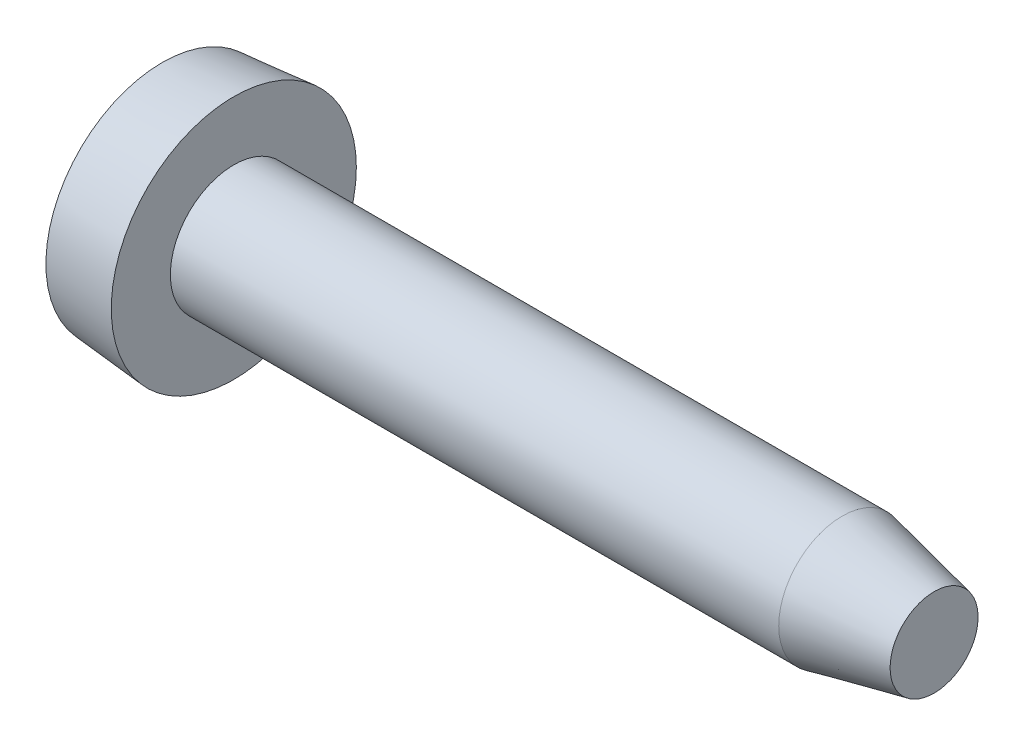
ISO-10303-21;
HEADER;
FILE_DESCRIPTION(('STEP AP214'),'2;1');
FILE_NAME('part.step','',(''),(''),'','','');
FILE_SCHEMA(('AUTOMOTIVE_DESIGN { 1 0 10303 214 1 1 1 1 }'));
ENDSEC;
DATA;
#1=APPLICATION_CONTEXT('core data for automotive mechanical design processes');
#2=APPLICATION_PROTOCOL_DEFINITION('international standard','automotive_design',2000,#1);
#3=PRODUCT_CONTEXT('',#1,'mechanical');
#4=PRODUCT('Part','Part','',(#3));
#5=PRODUCT_RELATED_PRODUCT_CATEGORY('part','',(#4));
#6=PRODUCT_DEFINITION_FORMATION('','',#4);
#7=PRODUCT_DEFINITION_CONTEXT('part definition',#1,'design');
#8=PRODUCT_DEFINITION('design','',#6,#7);
#9=PRODUCT_DEFINITION_SHAPE('','',#8);
#10=(LENGTH_UNIT() NAMED_UNIT(*) SI_UNIT(.MILLI.,.METRE.));
#11=(NAMED_UNIT(*) PLANE_ANGLE_UNIT() SI_UNIT($,.RADIAN.));
#12=(NAMED_UNIT(*) SI_UNIT($,.STERADIAN.) SOLID_ANGLE_UNIT());
#13=UNCERTAINTY_MEASURE_WITH_UNIT(LENGTH_MEASURE(1.E-05),#10,'distance_accuracy_value','');
#14=(GEOMETRIC_REPRESENTATION_CONTEXT(3) GLOBAL_UNCERTAINTY_ASSIGNED_CONTEXT((#13)) GLOBAL_UNIT_ASSIGNED_CONTEXT((#10,
#11,#12)) REPRESENTATION_CONTEXT('',''));
#15=CARTESIAN_POINT('',(0.,0.,0.));
#16=DIRECTION('',(0.,0.,1.));
#17=DIRECTION('',(1.,0.,0.));
#18=AXIS2_PLACEMENT_3D('',#15,#16,#17);
#19=CARTESIAN_POINT('',(-1.70366554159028,0.,-0.255));
#20=DIRECTION('',(0.,0.,1.));
#21=DIRECTION('',(1.,0.,0.));
#22=AXIS2_PLACEMENT_3D('',#19,#20,#21);
#23=PLANE('',#22);
#24=CARTESIAN_POINT('',(-2.38697804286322,-0.254999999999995,-0.255));
#25=CARTESIAN_POINT('',(-2.38080941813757,-0.375863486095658,-0.255000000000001));
#26=CARTESIAN_POINT('',(-2.37022720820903,-0.496488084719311,-0.255));
#27=CARTESIAN_POINT('',(-2.34040446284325,-0.736102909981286,-0.255));
#28=CARTESIAN_POINT('',(-2.321203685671,-0.855098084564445,-0.254999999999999));
#29=CARTESIAN_POINT('',(-2.26269549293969,-1.14959225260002,-0.255));
#30=CARTESIAN_POINT('',(-2.21814295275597,-1.32406276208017,-0.255000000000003));
#31=CARTESIAN_POINT('',(-2.16423628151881,-1.4956696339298,-0.25500000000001));
#32=B_SPLINE_CURVE_WITH_KNOTS('',3,(#24,#25,#26,#27,#28,#29,#30,#31),.UNSPECIFIED.,.F.,.F.,(4,2,
2,4),(0.,0.362956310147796,0.724255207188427,1.26345566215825),.UNSPECIFIED.);
#33=CARTESIAN_POINT('',(-2.38697804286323,-0.254999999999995,-0.255));
#34=VERTEX_POINT('',#33);
#35=CARTESIAN_POINT('',(-2.16423628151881,-1.49566963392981,-0.255000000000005));
#36=VERTEX_POINT('',#35);
#37=EDGE_CURVE('E19',#34,#36,#32,.T.);
#38=ORIENTED_EDGE('',*,*,#37,.T.);
#39=DIRECTION('',(0.78348098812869,0.621415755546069,0.));
#40=VECTOR('',#39,1.);
#41=CARTESIAN_POINT('',(-0.599999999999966,-0.254999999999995,-0.255));
#42=LINE('',#41,#40);
#43=CARTESIAN_POINT('',(-0.599999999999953,-0.254999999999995,-0.254999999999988));
#44=VERTEX_POINT('',#43);
#45=EDGE_CURVE('E79',#36,#44,#42,.T.);
#46=ORIENTED_EDGE('',*,*,#45,.T.);
#47=DIRECTION('',(1.,0.,0.));
#48=VECTOR('',#47,1.);
#49=CARTESIAN_POINT('',(-1.70366554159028,-0.254999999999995,-0.255));
#50=LINE('',#49,#48);
#51=EDGE_CURVE('E221',#44,#34,#50,.F.);
#52=ORIENTED_EDGE('',*,*,#51,.T.);
#53=EDGE_LOOP('',(#38,#46,#52));
#54=FACE_BOUND('',#53,.T.);
#55=ADVANCED_FACE('F15',(#54),#23,.T.);
#56=CARTESIAN_POINT('',(-1.70366554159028,-0.254999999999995,0.));
#57=DIRECTION('',(0.,-1.,0.));
#58=DIRECTION('',(0.,0.,-1.));
#59=AXIS2_PLACEMENT_3D('',#56,#57,#58);
#60=PLANE('',#59);
#61=ORIENTED_EDGE('',*,*,#51,.F.);
#62=DIRECTION('',(-0.78348098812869,0.,-0.621415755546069));
#63=VECTOR('',#62,1.);
#64=CARTESIAN_POINT('',(-0.599999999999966,-0.254999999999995,-0.254999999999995));
#65=LINE('',#64,#63);
#66=CARTESIAN_POINT('',(-2.16423628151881,-0.255,-1.49566963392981));
#67=VERTEX_POINT('',#66);
#68=EDGE_CURVE('E291',#44,#67,#65,.T.);
#69=ORIENTED_EDGE('',*,*,#68,.T.);
#70=CARTESIAN_POINT('',(-2.38697804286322,-0.254999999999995,-0.255));
#71=CARTESIAN_POINT('',(-2.38080941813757,-0.254999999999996,-0.375863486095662));
#72=CARTESIAN_POINT('',(-2.37022720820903,-0.254999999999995,-0.496488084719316));
#73=CARTESIAN_POINT('',(-2.34040446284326,-0.254999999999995,-0.736102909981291));
#74=CARTESIAN_POINT('',(-2.321203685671,-0.254999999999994,-0.85509808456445));
#75=CARTESIAN_POINT('',(-2.2626954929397,-0.254999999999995,-1.14959225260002));
#76=CARTESIAN_POINT('',(-2.21814295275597,-0.254999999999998,-1.32406276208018));
#77=CARTESIAN_POINT('',(-2.16423628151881,-0.255000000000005,-1.4956696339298));
#78=B_SPLINE_CURVE_WITH_KNOTS('',3,(#70,#71,#72,#73,#74,#75,#76,#77),.UNSPECIFIED.,.F.,.F.,(4,2,
2,4),(0.,0.362956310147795,0.724255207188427,1.26345566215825),.UNSPECIFIED.);
#79=EDGE_CURVE('E216',#34,#67,#78,.T.);
#80=ORIENTED_EDGE('',*,*,#79,.F.);
#81=EDGE_LOOP('',(#61,#69,#80));
#82=FACE_BOUND('',#81,.T.);
#83=ADVANCED_FACE('F222',(#82),#60,.F.);
#84=CARTESIAN_POINT('',(-0.599999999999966,-0.254999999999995,0.));
#85=DIRECTION('',(0.621415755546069,-0.78348098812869,0.));
#86=DIRECTION('',(0.78348098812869,0.621415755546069,0.));
#87=AXIS2_PLACEMENT_3D('',#84,#85,#86);
#88=PLANE('',#87);
#89=DIRECTION('',(0.783480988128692,0.621415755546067,0.));
#90=VECTOR('',#89,1.);
#91=CARTESIAN_POINT('',(-2.16423628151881,-1.49566963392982,0.255));
#92=LINE('',#91,#90);
#93=CARTESIAN_POINT('',(-2.16423628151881,-1.49566963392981,0.255000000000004));
#94=VERTEX_POINT('',#93);
#95=CARTESIAN_POINT('',(-0.599999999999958,-0.254999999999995,0.25500000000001));
#96=VERTEX_POINT('',#95);
#97=EDGE_CURVE('E330',#94,#96,#92,.T.);
#98=ORIENTED_EDGE('',*,*,#97,.T.);
#99=DIRECTION('',(0.,0.,1.));
#100=VECTOR('',#99,1.);
#101=CARTESIAN_POINT('',(-0.599999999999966,-0.254999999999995,0.));
#102=LINE('',#101,#100);
#103=EDGE_CURVE('E98',#44,#96,#102,.T.);
#104=ORIENTED_EDGE('',*,*,#103,.F.);
#105=ORIENTED_EDGE('',*,*,#45,.F.);
#106=CARTESIAN_POINT('',(-2.1642362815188,-1.49566963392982,0.255));
#107=CARTESIAN_POINT('',(-2.16787609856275,-1.49855654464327,0.17));
#108=CARTESIAN_POINT('',(-2.16969600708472,-1.5,0.0850000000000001));
#109=CARTESIAN_POINT('',(-2.16969600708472,-1.5,-0.0849999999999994));
#110=CARTESIAN_POINT('',(-2.16787609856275,-1.49855654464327,-0.169999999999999));
#111=CARTESIAN_POINT('',(-2.1642362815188,-1.49566963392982,-0.254999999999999));
#112=B_SPLINE_CURVE_WITH_KNOTS('',3,(#106,#107,#108,#109,#110,#111),.UNSPECIFIED.,.F.,.F.,(4,2,
4),(0.,0.255095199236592,0.510190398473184),.UNSPECIFIED.);
#113=EDGE_CURVE('E211',#94,#36,#112,.T.);
#114=ORIENTED_EDGE('',*,*,#113,.F.);
#115=EDGE_LOOP('',(#98,#104,#105,#114));
#116=FACE_BOUND('',#115,.T.);
#117=ADVANCED_FACE('F225',(#116),#88,.F.);
#118=CARTESIAN_POINT('',(-0.599999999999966,0.,-0.254999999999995));
#119=DIRECTION('',(0.621415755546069,0.,-0.78348098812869));
#120=DIRECTION('',(-0.78348098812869,0.,-0.621415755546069));
#121=AXIS2_PLACEMENT_3D('',#118,#119,#120);
#122=PLANE('',#121);
#123=ORIENTED_EDGE('',*,*,#68,.F.);
#124=DIRECTION('',(0.,1.,0.));
#125=VECTOR('',#124,1.);
#126=CARTESIAN_POINT('',(-0.599999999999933,0.,-0.254999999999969));
#127=LINE('',#126,#125);
#128=CARTESIAN_POINT('',(-0.599999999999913,0.254999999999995,-0.254999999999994));
#129=VERTEX_POINT('',#128);
#130=EDGE_CURVE('E289',#129,#44,#127,.F.);
#131=ORIENTED_EDGE('',*,*,#130,.F.);
#132=DIRECTION('',(0.783480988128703,0.,0.621415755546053));
#133=VECTOR('',#132,1.);
#134=CARTESIAN_POINT('',(-2.16423628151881,0.254999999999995,-1.49566963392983));
#135=LINE('',#134,#133);
#136=CARTESIAN_POINT('',(-2.16423628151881,0.254999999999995,-1.49566963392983));
#137=VERTEX_POINT('',#136);
#138=EDGE_CURVE('E323',#137,#129,#135,.T.);
#139=ORIENTED_EDGE('',*,*,#138,.F.);
#140=CARTESIAN_POINT('',(-2.16423628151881,-0.254999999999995,-1.49566963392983));
#141=CARTESIAN_POINT('',(-2.16787609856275,-0.169999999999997,-1.49855654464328));
#142=CARTESIAN_POINT('',(-2.16969600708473,-0.084999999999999,-1.5));
#143=CARTESIAN_POINT('',(-2.16969600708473,0.084999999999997,-1.5));
#144=CARTESIAN_POINT('',(-2.16787609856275,0.169999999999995,-1.49855654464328));
#145=CARTESIAN_POINT('',(-2.16423628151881,0.254999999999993,-1.49566963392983));
#146=B_SPLINE_CURVE_WITH_KNOTS('',3,(#140,#141,#142,#143,#144,#145),.UNSPECIFIED.,.F.,.F.,(4,2,
4),(0.,0.255095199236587,0.510190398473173),.UNSPECIFIED.);
#147=EDGE_CURVE('E205',#67,#137,#146,.T.);
#148=ORIENTED_EDGE('',*,*,#147,.F.);
#149=EDGE_LOOP('',(#123,#131,#139,#148));
#150=FACE_BOUND('',#149,.T.);
#151=ADVANCED_FACE('F230',(#150),#122,.F.);
#152=CARTESIAN_POINT('',(-1.70366554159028,0.,0.255));
#153=DIRECTION('',(0.,0.,1.));
#154=DIRECTION('',(1.,0.,0.));
#155=AXIS2_PLACEMENT_3D('',#152,#153,#154);
#156=PLANE('',#155);
#157=ORIENTED_EDGE('',*,*,#97,.F.);
#158=CARTESIAN_POINT('',(-2.38697804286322,-0.254999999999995,0.255));
#159=CARTESIAN_POINT('',(-2.38080941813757,-0.375863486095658,0.255));
#160=CARTESIAN_POINT('',(-2.37022720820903,-0.496488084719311,0.255));
#161=CARTESIAN_POINT('',(-2.34040446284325,-0.736102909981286,0.255));
#162=CARTESIAN_POINT('',(-2.321203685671,-0.855098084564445,0.255));
#163=CARTESIAN_POINT('',(-2.26269549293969,-1.14959225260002,0.255000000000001));
#164=CARTESIAN_POINT('',(-2.21814295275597,-1.32406276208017,0.255000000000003));
#165=CARTESIAN_POINT('',(-2.16423628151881,-1.4956696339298,0.255000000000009));
#166=B_SPLINE_CURVE_WITH_KNOTS('',3,(#158,#159,#160,#161,#162,#163,#164,#165),.UNSPECIFIED.,.F.,
.F.,(4,2,2,4),(0.,0.362956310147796,0.724255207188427,1.26345566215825),.UNSPECIFIED.);
#167=CARTESIAN_POINT('',(-2.38697804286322,-0.254999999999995,0.255));
#168=VERTEX_POINT('',#167);
#169=EDGE_CURVE('E198',#168,#94,#166,.T.);
#170=ORIENTED_EDGE('',*,*,#169,.F.);
#171=DIRECTION('',(1.,0.,0.));
#172=VECTOR('',#171,1.);
#173=CARTESIAN_POINT('',(-1.70366554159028,-0.254999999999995,0.255));
#174=LINE('',#173,#172);
#175=EDGE_CURVE('E320',#168,#96,#174,.T.);
#176=ORIENTED_EDGE('',*,*,#175,.T.);
#177=EDGE_LOOP('',(#157,#170,#176));
#178=FACE_BOUND('',#177,.T.);
#179=ADVANCED_FACE('F234',(#178),#156,.F.);
#180=CARTESIAN_POINT('',(-1.70366554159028,0.254999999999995,0.));
#181=DIRECTION('',(0.,-1.,0.));
#182=DIRECTION('',(0.,0.,-1.));
#183=AXIS2_PLACEMENT_3D('',#180,#181,#182);
#184=PLANE('',#183);
#185=ORIENTED_EDGE('',*,*,#138,.T.);
#186=DIRECTION('',(1.,0.,0.));
#187=VECTOR('',#186,1.);
#188=CARTESIAN_POINT('',(-1.70366554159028,0.254999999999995,-0.255));
#189=LINE('',#188,#187);
#190=CARTESIAN_POINT('',(-2.38697804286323,0.254999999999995,-0.255));
#191=VERTEX_POINT('',#190);
#192=EDGE_CURVE('E316',#191,#129,#189,.T.);
#193=ORIENTED_EDGE('',*,*,#192,.F.);
#194=CARTESIAN_POINT('',(-2.38697804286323,0.254999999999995,-0.255));
#195=CARTESIAN_POINT('',(-2.38080941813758,0.254999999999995,-0.375863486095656));
#196=CARTESIAN_POINT('',(-2.37022720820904,0.254999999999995,-0.496488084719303));
#197=CARTESIAN_POINT('',(-2.34040446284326,0.254999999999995,-0.736102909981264));
#198=CARTESIAN_POINT('',(-2.32120368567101,0.254999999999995,-0.855098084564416));
#199=CARTESIAN_POINT('',(-2.2626954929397,0.254999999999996,-1.1495922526));
#200=CARTESIAN_POINT('',(-2.21814295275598,0.254999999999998,-1.32406276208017));
#201=CARTESIAN_POINT('',(-2.16423628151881,0.255000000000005,-1.4956696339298));
#202=B_SPLINE_CURVE_WITH_KNOTS('',3,(#194,#195,#196,#197,#198,#199,#200,#201),.UNSPECIFIED.,.F.,
.F.,(4,2,2,4),(0.,0.362956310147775,0.724255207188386,1.26345566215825),.UNSPECIFIED.);
#203=EDGE_CURVE('E191',#191,#137,#202,.T.);
#204=ORIENTED_EDGE('',*,*,#203,.T.);
#205=EDGE_LOOP('',(#185,#193,#204));
#206=FACE_BOUND('',#205,.T.);
#207=ADVANCED_FACE('F238',(#206),#184,.T.);
#208=CARTESIAN_POINT('',(-1.70366554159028,-0.254999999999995,0.));
#209=DIRECTION('',(0.,-1.,0.));
#210=DIRECTION('',(0.,0.,-1.));
#211=AXIS2_PLACEMENT_3D('',#208,#209,#210);
#212=PLANE('',#211);
#213=DIRECTION('',(0.783480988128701,0.,-0.621415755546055));
#214=VECTOR('',#213,1.);
#215=CARTESIAN_POINT('',(-2.16969600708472,-0.254999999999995,1.5));
#216=LINE('',#215,#214);
#217=CARTESIAN_POINT('',(-2.16423628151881,-0.254999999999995,1.49566963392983));
#218=VERTEX_POINT('',#217);
#219=EDGE_CURVE('E103',#218,#96,#216,.T.);
#220=ORIENTED_EDGE('',*,*,#219,.T.);
#221=ORIENTED_EDGE('',*,*,#175,.F.);
#222=CARTESIAN_POINT('',(-2.16423628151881,-0.254999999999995,1.49566963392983));
#223=CARTESIAN_POINT('',(-2.21469075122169,-0.254999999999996,1.3350971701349));
#224=CARTESIAN_POINT('',(-2.25695855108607,-0.254999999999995,1.17192070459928));
#225=CARTESIAN_POINT('',(-2.32461908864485,-0.254999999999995,0.8431826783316));
#226=CARTESIAN_POINT('',(-2.35011698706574,-0.254999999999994,0.677642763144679));
#227=CARTESIAN_POINT('',(-2.37602868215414,-0.254999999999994,0.426031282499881));
#228=CARTESIAN_POINT('',(-2.38261125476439,-0.254999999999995,0.340564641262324));
#229=CARTESIAN_POINT('',(-2.38697804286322,-0.254999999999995,0.254999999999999));
#230=B_SPLINE_CURVE_WITH_KNOTS('',3,(#222,#223,#224,#225,#226,#227,#228,#229),.UNSPECIFIED.,.F.,
.F.,(4,2,2,4),(0.,0.504788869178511,1.00638133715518,1.26342207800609),.UNSPECIFIED.);
#231=EDGE_CURVE('E184',#218,#168,#230,.T.);
#232=ORIENTED_EDGE('',*,*,#231,.F.);
#233=EDGE_LOOP('',(#220,#221,#232));
#234=FACE_BOUND('',#233,.T.);
#235=ADVANCED_FACE('F242',(#234),#212,.F.);
#236=CARTESIAN_POINT('',(-0.599999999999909,0.254999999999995,0.));
#237=DIRECTION('',(1.,-1.114577E-13,0.));
#238=DIRECTION('',(1.114577E-13,1.,0.));
#239=AXIS2_PLACEMENT_3D('',#236,#237,#238);
#240=PLANE('',#239);
#241=DIRECTION('',(0.,0.,1.));
#242=VECTOR('',#241,1.);
#243=CARTESIAN_POINT('',(-0.599999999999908,0.254999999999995,0.));
#244=LINE('',#243,#242);
#245=CARTESIAN_POINT('',(-0.599999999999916,0.254999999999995,0.255000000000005));
#246=VERTEX_POINT('',#245);
#247=EDGE_CURVE('E95',#246,#129,#244,.F.);
#248=ORIENTED_EDGE('',*,*,#247,.T.);
#249=ORIENTED_EDGE('',*,*,#130,.T.);
#250=ORIENTED_EDGE('',*,*,#103,.T.);
#251=DIRECTION('',(0.,1.,0.));
#252=VECTOR('',#251,1.);
#253=CARTESIAN_POINT('',(-0.599999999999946,0.,0.255000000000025));
#254=LINE('',#253,#252);
#255=EDGE_CURVE('E90',#96,#246,#254,.T.);
#256=ORIENTED_EDGE('',*,*,#255,.T.);
#257=EDGE_LOOP('',(#248,#249,#250,#256));
#258=FACE_BOUND('',#257,.T.);
#259=ADVANCED_FACE('F92',(#258),#240,.F.);
#260=CARTESIAN_POINT('',(-1.70366554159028,0.,-0.255));
#261=DIRECTION('',(0.,0.,1.));
#262=DIRECTION('',(1.,0.,0.));
#263=AXIS2_PLACEMENT_3D('',#260,#261,#262);
#264=PLANE('',#263);
#265=DIRECTION('',(-0.783480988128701,0.621415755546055,0.));
#266=VECTOR('',#265,1.);
#267=CARTESIAN_POINT('',(-2.16969600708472,1.5,-0.255));
#268=LINE('',#267,#266);
#269=CARTESIAN_POINT('',(-2.16423628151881,1.49566963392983,-0.255));
#270=VERTEX_POINT('',#269);
#271=EDGE_CURVE('E121',#129,#270,#268,.T.);
#272=ORIENTED_EDGE('',*,*,#271,.T.);
#273=CARTESIAN_POINT('',(-2.16423628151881,1.49566963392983,-0.255));
#274=CARTESIAN_POINT('',(-2.21469075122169,1.33509717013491,-0.254999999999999));
#275=CARTESIAN_POINT('',(-2.25695855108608,1.17192070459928,-0.255));
#276=CARTESIAN_POINT('',(-2.32461908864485,0.843182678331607,-0.255000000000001));
#277=CARTESIAN_POINT('',(-2.35011698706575,0.677642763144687,-0.255000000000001));
#278=CARTESIAN_POINT('',(-2.37602868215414,0.426031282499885,-0.255000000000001));
#279=CARTESIAN_POINT('',(-2.38261125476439,0.340564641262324,-0.255000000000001));
#280=CARTESIAN_POINT('',(-2.38697804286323,0.254999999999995,-0.255));
#281=B_SPLINE_CURVE_WITH_KNOTS('',3,(#273,#274,#275,#276,#277,#278,#279,#280),.UNSPECIFIED.,.F.,
.F.,(4,2,2,4),(0.,0.504788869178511,1.00638133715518,1.26342207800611),.UNSPECIFIED.);
#282=EDGE_CURVE('E177',#270,#191,#281,.T.);
#283=ORIENTED_EDGE('',*,*,#282,.T.);
#284=ORIENTED_EDGE('',*,*,#192,.T.);
#285=EDGE_LOOP('',(#272,#283,#284));
#286=FACE_BOUND('',#285,.T.);
#287=ADVANCED_FACE('F249',(#286),#264,.T.);
#288=CARTESIAN_POINT('',(-2.16969600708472,0.,1.5));
#289=DIRECTION('',(0.621415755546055,0.,0.783480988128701));
#290=DIRECTION('',(0.783480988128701,0.,-0.621415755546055));
#291=AXIS2_PLACEMENT_3D('',#288,#289,#290);
#292=PLANE('',#291);
#293=DIRECTION('',(-0.783480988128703,0.,0.621415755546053));
#294=VECTOR('',#293,1.);
#295=CARTESIAN_POINT('',(-0.599999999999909,0.254999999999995,0.255));
#296=LINE('',#295,#294);
#297=CARTESIAN_POINT('',(-2.16423628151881,0.254999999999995,1.49566963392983));
#298=VERTEX_POINT('',#297);
#299=EDGE_CURVE('E107',#246,#298,#296,.T.);
#300=ORIENTED_EDGE('',*,*,#299,.F.);
#301=ORIENTED_EDGE('',*,*,#255,.F.);
#302=ORIENTED_EDGE('',*,*,#219,.F.);
#303=CARTESIAN_POINT('',(-2.16423628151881,0.254999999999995,1.49566963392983));
#304=CARTESIAN_POINT('',(-2.16787609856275,0.169999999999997,1.49855654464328));
#305=CARTESIAN_POINT('',(-2.16969600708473,0.0849999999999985,1.5));
#306=CARTESIAN_POINT('',(-2.16969600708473,-0.0849999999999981,1.5));
#307=CARTESIAN_POINT('',(-2.16787609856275,-0.169999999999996,1.49855654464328));
#308=CARTESIAN_POINT('',(-2.16423628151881,-0.254999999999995,1.49566963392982));
#309=B_SPLINE_CURVE_WITH_KNOTS('',3,(#303,#304,#305,#306,#307,#308),.UNSPECIFIED.,.F.,.F.,(4,2,
4),(0.,0.255095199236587,0.510190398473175),.UNSPECIFIED.);
#310=EDGE_CURVE('E102',#298,#218,#309,.T.);
#311=ORIENTED_EDGE('',*,*,#310,.F.);
#312=EDGE_LOOP('',(#300,#301,#302,#311));
#313=FACE_BOUND('',#312,.T.);
#314=ADVANCED_FACE('F108',(#313),#292,.F.);
#315=CARTESIAN_POINT('',(-2.16969600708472,1.5,0.));
#316=DIRECTION('',(0.621415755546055,0.783480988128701,0.));
#317=DIRECTION('',(-0.783480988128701,0.621415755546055,0.));
#318=AXIS2_PLACEMENT_3D('',#315,#316,#317);
#319=PLANE('',#318);
#320=ORIENTED_EDGE('',*,*,#271,.F.);
#321=ORIENTED_EDGE('',*,*,#247,.F.);
#322=DIRECTION('',(-0.783480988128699,0.621415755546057,0.));
#323=VECTOR('',#322,1.);
#324=CARTESIAN_POINT('',(-0.599999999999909,0.254999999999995,0.255));
#325=LINE('',#324,#323);
#326=CARTESIAN_POINT('',(-2.16423628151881,1.49566963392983,0.255));
#327=VERTEX_POINT('',#326);
#328=EDGE_CURVE('E112',#246,#327,#325,.T.);
#329=ORIENTED_EDGE('',*,*,#328,.T.);
#330=CARTESIAN_POINT('',(-2.16423628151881,1.49566963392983,-0.254999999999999));
#331=CARTESIAN_POINT('',(-2.16787609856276,1.49855654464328,-0.17));
#332=CARTESIAN_POINT('',(-2.16969600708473,1.5,-0.0849999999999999));
#333=CARTESIAN_POINT('',(-2.16969600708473,1.5,0.0849999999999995));
#334=CARTESIAN_POINT('',(-2.16787609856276,1.49855654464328,0.169999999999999));
#335=CARTESIAN_POINT('',(-2.16423628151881,1.49566963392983,0.254999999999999));
#336=B_SPLINE_CURVE_WITH_KNOTS('',3,(#330,#331,#332,#333,#334,#335),.UNSPECIFIED.,.F.,.F.,(4,2,
4),(0.,0.255095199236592,0.510190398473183),.UNSPECIFIED.);
#337=EDGE_CURVE('E39',#270,#327,#336,.T.);
#338=ORIENTED_EDGE('',*,*,#337,.F.);
#339=EDGE_LOOP('',(#320,#321,#329,#338));
#340=FACE_BOUND('',#339,.T.);
#341=ADVANCED_FACE('F117',(#340),#319,.F.);
#342=CARTESIAN_POINT('',(-1.70366554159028,0.254999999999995,0.));
#343=DIRECTION('',(0.,-1.,0.));
#344=DIRECTION('',(0.,0.,-1.));
#345=AXIS2_PLACEMENT_3D('',#342,#343,#344);
#346=PLANE('',#345);
#347=DIRECTION('',(1.,0.,0.));
#348=VECTOR('',#347,1.);
#349=CARTESIAN_POINT('',(-1.70366554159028,0.254999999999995,0.255));
#350=LINE('',#349,#348);
#351=CARTESIAN_POINT('',(-2.38697804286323,0.254999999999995,0.255));
#352=VERTEX_POINT('',#351);
#353=EDGE_CURVE('E124',#352,#246,#350,.T.);
#354=ORIENTED_EDGE('',*,*,#353,.T.);
#355=ORIENTED_EDGE('',*,*,#299,.T.);
#356=CARTESIAN_POINT('',(-2.16423628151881,0.254999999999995,1.49566963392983));
#357=CARTESIAN_POINT('',(-2.21469075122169,0.254999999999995,1.33509717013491));
#358=CARTESIAN_POINT('',(-2.25695855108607,0.254999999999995,1.17192070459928));
#359=CARTESIAN_POINT('',(-2.32461908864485,0.254999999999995,0.843182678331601));
#360=CARTESIAN_POINT('',(-2.35011698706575,0.254999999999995,0.67764276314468));
#361=CARTESIAN_POINT('',(-2.37602868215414,0.254999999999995,0.426031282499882));
#362=CARTESIAN_POINT('',(-2.38261125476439,0.254999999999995,0.340564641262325));
#363=CARTESIAN_POINT('',(-2.38697804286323,0.254999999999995,0.255));
#364=B_SPLINE_CURVE_WITH_KNOTS('',3,(#356,#357,#358,#359,#360,#361,#362,#363),.UNSPECIFIED.,.F.,
.F.,(4,2,2,4),(0.,0.504788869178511,1.00638133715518,1.26342207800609),.UNSPECIFIED.);
#365=EDGE_CURVE('E113',#298,#352,#364,.T.);
#366=ORIENTED_EDGE('',*,*,#365,.T.);
#367=EDGE_LOOP('',(#354,#355,#366));
#368=FACE_BOUND('',#367,.T.);
#369=ADVANCED_FACE('F125',(#368),#346,.T.);
#370=CARTESIAN_POINT('',(-1.70366554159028,0.,0.255));
#371=DIRECTION('',(0.,0.,1.));
#372=DIRECTION('',(1.,0.,0.));
#373=AXIS2_PLACEMENT_3D('',#370,#371,#372);
#374=PLANE('',#373);
#375=CARTESIAN_POINT('',(-2.16423628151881,1.49566963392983,0.255));
#376=CARTESIAN_POINT('',(-2.21469075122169,1.33509717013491,0.254999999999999));
#377=CARTESIAN_POINT('',(-2.25695855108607,1.17192070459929,0.255));
#378=CARTESIAN_POINT('',(-2.32461908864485,0.84318267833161,0.255));
#379=CARTESIAN_POINT('',(-2.35011698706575,0.677642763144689,0.255000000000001));
#380=CARTESIAN_POINT('',(-2.37602868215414,0.426031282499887,0.255000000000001));
#381=CARTESIAN_POINT('',(-2.38261125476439,0.340564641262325,0.255000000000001));
#382=CARTESIAN_POINT('',(-2.38697804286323,0.254999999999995,0.255));
#383=B_SPLINE_CURVE_WITH_KNOTS('',3,(#375,#376,#377,#378,#379,#380,#381,#382),.UNSPECIFIED.,.F.,
.F.,(4,2,2,4),(0.,0.504788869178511,1.00638133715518,1.26342207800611),.UNSPECIFIED.);
#384=EDGE_CURVE('E127',#327,#352,#383,.T.);
#385=ORIENTED_EDGE('',*,*,#384,.F.);
#386=ORIENTED_EDGE('',*,*,#328,.F.);
#387=ORIENTED_EDGE('',*,*,#353,.F.);
#388=EDGE_LOOP('',(#385,#386,#387));
#389=FACE_BOUND('',#388,.T.);
#390=ADVANCED_FACE('F129',(#389),#374,.F.);
#391=CARTESIAN_POINT('',(2.60000000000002,0.,0.));
#392=DIRECTION('',(1.,0.,0.));
#393=DIRECTION('',(0.,1.,0.));
#394=AXIS2_PLACEMENT_3D('',#391,#392,#393);
#395=SPHERICAL_SURFACE('',#394,5.00000000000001);
#396=CARTESIAN_POINT('',(-1.63566947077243,0.,0.));
#397=DIRECTION('',(1.,0.,0.));
#398=DIRECTION('',(0.,1.,0.));
#399=AXIS2_PLACEMENT_3D('',#396,#397,#398);
#400=CIRCLE('',#399,2.65689746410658);
#401=CARTESIAN_POINT('',(-1.63566947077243,2.65689746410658,0.));
#402=VERTEX_POINT('',#401);
#403=EDGE_CURVE('E138',#402,#402,#400,.T.);
#404=ORIENTED_EDGE('',*,*,#403,.F.);
#405=EDGE_LOOP('',(#404));
#406=FACE_BOUND('',#405,.T.);
#407=ORIENTED_EDGE('',*,*,#337,.T.);
#408=ORIENTED_EDGE('',*,*,#384,.T.);
#409=ORIENTED_EDGE('',*,*,#365,.F.);
#410=ORIENTED_EDGE('',*,*,#310,.T.);
#411=ORIENTED_EDGE('',*,*,#231,.T.);
#412=ORIENTED_EDGE('',*,*,#169,.T.);
#413=ORIENTED_EDGE('',*,*,#113,.T.);
#414=ORIENTED_EDGE('',*,*,#37,.F.);
#415=ORIENTED_EDGE('',*,*,#79,.T.);
#416=ORIENTED_EDGE('',*,*,#147,.T.);
#417=ORIENTED_EDGE('',*,*,#203,.F.);
#418=ORIENTED_EDGE('',*,*,#282,.F.);
#419=EDGE_LOOP('',(#407,#408,#409,#410,#411,#412,#413,#414,#415,#416,#417,#418));
#420=FACE_BOUND('',#419,.T.);
#421=ADVANCED_FACE('F140',(#406,#420),#395,.T.);
#422=CARTESIAN_POINT('',(16.,0.502499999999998,0.));
#423=DIRECTION('',(1.,0.,0.));
#424=DIRECTION('',(0.,0.,-1.));
#425=AXIS2_PLACEMENT_3D('',#422,#423,#424);
#426=PLANE('',#425);
#427=CARTESIAN_POINT('',(16.0000000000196,0.,0.));
#428=DIRECTION('',(-1.,0.,0.));
#429=DIRECTION('',(0.,0.,1.));
#430=AXIS2_PLACEMENT_3D('',#427,#428,#429);
#431=CIRCLE('',#430,1.00500000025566);
#432=CARTESIAN_POINT('',(16.0000000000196,0.,1.00500000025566));
#433=VERTEX_POINT('',#432);
#434=EDGE_CURVE('E279',#433,#433,#431,.T.);
#435=ORIENTED_EDGE('',*,*,#434,.F.);
#436=EDGE_LOOP('',(#435));
#437=FACE_BOUND('',#436,.T.);
#438=ADVANCED_FACE('F145',(#437),#426,.T.);
#439=CARTESIAN_POINT('',(-1.13686837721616E-10,0.,0.));
#440=DIRECTION('',(1.,0.,0.));
#441=DIRECTION('',(0.,0.,-1.));
#442=AXIS2_PLACEMENT_3D('',#439,#440,#441);
#443=CONICAL_SURFACE('',#442,2.7999999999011,0.0872664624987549);
#444=ORIENTED_EDGE('',*,*,#403,.T.);
#445=EDGE_LOOP('',(#444));
#446=FACE_BOUND('',#445,.T.);
#447=CARTESIAN_POINT('',(0.,0.,0.));
#448=DIRECTION('',(1.,0.,0.));
#449=DIRECTION('',(0.,0.,-1.));
#450=AXIS2_PLACEMENT_3D('',#447,#448,#449);
#451=CIRCLE('',#450,2.79999999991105);
#452=CARTESIAN_POINT('',(0.,0.,-2.79999999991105));
#453=VERTEX_POINT('',#452);
#454=EDGE_CURVE('E276',#453,#453,#451,.T.);
#455=ORIENTED_EDGE('',*,*,#454,.F.);
#456=EDGE_LOOP('',(#455));
#457=FACE_BOUND('',#456,.T.);
#458=ADVANCED_FACE('F415',(#446,#457),#443,.T.);
#459=CARTESIAN_POINT('',(13.9000000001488,0.,0.));
#460=DIRECTION('',(-1.,0.,0.));
#461=DIRECTION('',(0.,0.,1.));
#462=AXIS2_PLACEMENT_3D('',#459,#460,#461);
#463=CONICAL_SURFACE('',#462,1.44999999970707,0.208815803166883);
#464=CARTESIAN_POINT('',(13.8999999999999,0.,0.));
#465=DIRECTION('',(1.,0.,0.));
#466=DIRECTION('',(0.,0.,-1.));
#467=AXIS2_PLACEMENT_3D('',#464,#465,#466);
#468=CIRCLE('',#467,1.45000000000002);
#469=CARTESIAN_POINT('',(13.8999999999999,0.,-1.45000000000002));
#470=VERTEX_POINT('',#469);
#471=EDGE_CURVE('E30',#470,#470,#468,.F.);
#472=ORIENTED_EDGE('',*,*,#471,.F.);
#473=EDGE_LOOP('',(#472));
#474=FACE_BOUND('',#473,.T.);
#475=ORIENTED_EDGE('',*,*,#434,.T.);
#476=EDGE_LOOP('',(#475));
#477=FACE_BOUND('',#476,.T.);
#478=ADVANCED_FACE('F269',(#474,#477),#463,.T.);
#479=CARTESIAN_POINT('',(0.,2.12500000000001,0.));
#480=DIRECTION('',(1.,0.,0.));
#481=DIRECTION('',(0.,0.,-1.));
#482=AXIS2_PLACEMENT_3D('',#479,#480,#481);
#483=PLANE('',#482);
#484=CARTESIAN_POINT('',(0.,0.,0.));
#485=DIRECTION('',(1.,0.,0.));
#486=DIRECTION('',(0.,0.,-1.));
#487=AXIS2_PLACEMENT_3D('',#484,#485,#486);
#488=CIRCLE('',#487,1.45000000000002);
#489=CARTESIAN_POINT('',(0.,0.,-1.45000000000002));
#490=VERTEX_POINT('',#489);
#491=EDGE_CURVE('E10',#490,#490,#488,.T.);
#492=ORIENTED_EDGE('',*,*,#491,.F.);
#493=EDGE_LOOP('',(#492));
#494=FACE_BOUND('',#493,.T.);
#495=ORIENTED_EDGE('',*,*,#454,.T.);
#496=EDGE_LOOP('',(#495));
#497=FACE_BOUND('',#496,.T.);
#498=ADVANCED_FACE('F264',(#494,#497),#483,.T.);
#499=CARTESIAN_POINT('',(6.94999999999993,0.,0.));
#500=DIRECTION('',(1.,0.,0.));
#501=DIRECTION('',(0.,0.,-1.));
#502=AXIS2_PLACEMENT_3D('',#499,#500,#501);
#503=CYLINDRICAL_SURFACE('',#502,1.45000000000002);
#504=ORIENTED_EDGE('',*,*,#491,.T.);
#505=EDGE_LOOP('',(#504));
#506=FACE_BOUND('',#505,.T.);
#507=ORIENTED_EDGE('',*,*,#471,.T.);
#508=EDGE_LOOP('',(#507));
#509=FACE_BOUND('',#508,.T.);
#510=ADVANCED_FACE('F17',(#506,#509),#503,.T.);
#511=CLOSED_SHELL('',(#55,#83,#117,#151,#179,#207,#235,#259,#287,#314,#341,#369,#390,#421,#438,
#458,#478,#498,#510));
#512=MANIFOLD_SOLID_BREP('B1',#511);
#513=ADVANCED_BREP_SHAPE_REPRESENTATION('',(#18,#512),#14);
#514=SHAPE_DEFINITION_REPRESENTATION(#9,#513);
ENDSEC;
END-ISO-10303-21;
